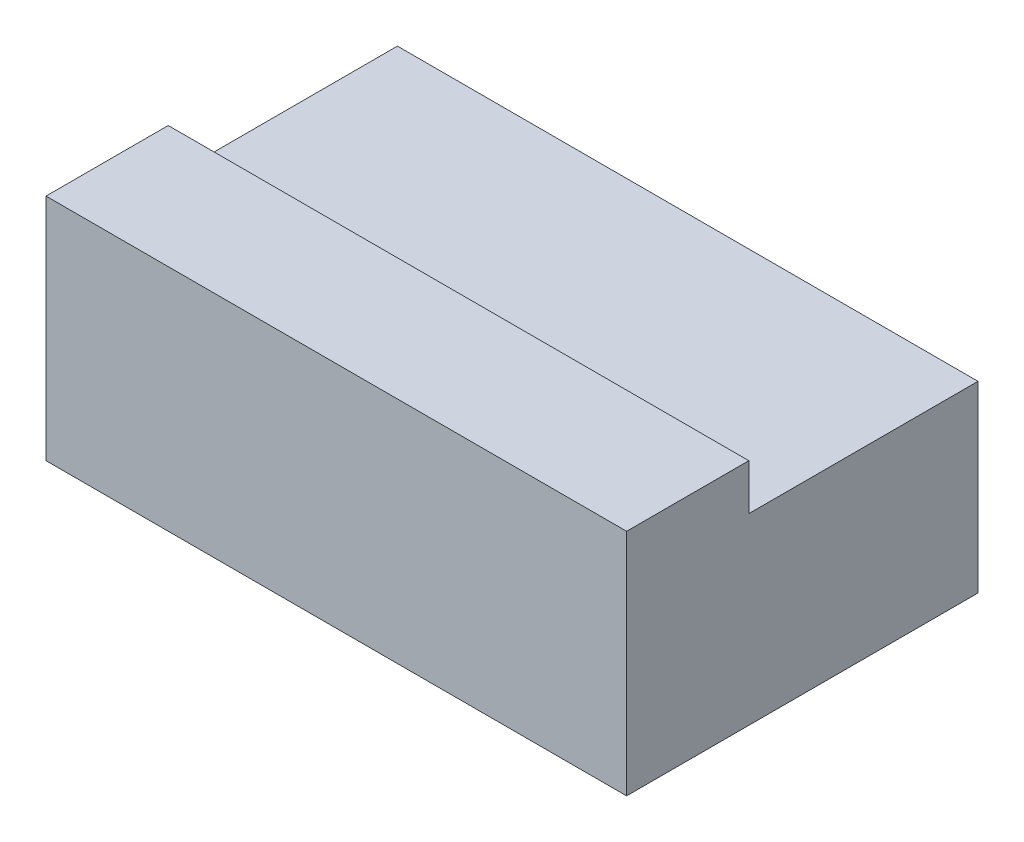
from build123d import *

# Parameters (mm, degrees)
SKETCH1_W           = 190
SKETCH1_H           = 115
BOSS_EXTRUDE1_DEPTH = 37.5
SKETCH5_W           = 190
SKETCH5_H           = 75
CUT_EXTRUDE4_DEPTH  = 15


with BuildPart() as part:
    # Sketch1 → Boss-Extrude1 (new, symmetric)
    with BuildSketch(Plane(origin=(0, 0, 0), x_dir=(1, 0, 0), z_dir=(0, 1, 0))):
        Rectangle(SKETCH1_W, SKETCH1_H)
    extrude(amount=BOSS_EXTRUDE1_DEPTH, both=True)

    # Sketch5 → Cut-Extrude4 (cut)
    with BuildSketch(Plane(origin=(0, 37.5, 0), x_dir=(1, 0, 0), z_dir=(0, 1, 0))):
        with Locations((0, 20)):
            Rectangle(SKETCH5_W, SKETCH5_H)
    extrude(amount=-CUT_EXTRUDE4_DEPTH, mode=Mode.SUBTRACT)


solid = part.part
